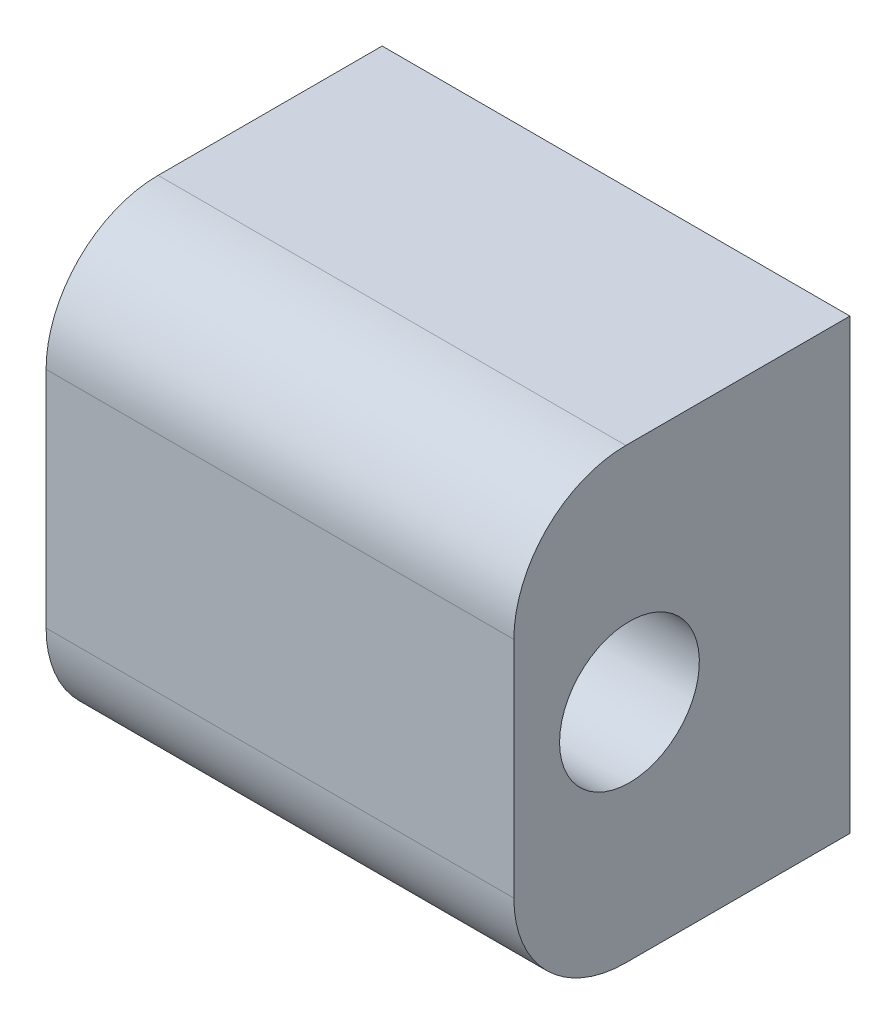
from build123d import *
from OCP.BRepFilletAPI import BRepFilletAPI_MakeChamfer

# Parameters (mm, degrees)
BOSS_EXTRUDE2_DEPTH = 19.05
SKETCH5_R           = 3.9624
CUT_EXTRUDE1_DEPTH  = 31.75
SKETCH6_R           = 3.175
CUT_EXTRUDE3_DEPTH  = 17.272
FILLET1_R           = 6.35
CHAMFER1_SIZE       = 1.778
CHAMFER1_SIZE2      = 2.95908892


with BuildPart() as part:
    # Sketch4 → Boss-Extrude2 (new body)
    with BuildSketch(Plane.XY):
        Polygon((-13.2588, -12.7), (13.2588, -12.7), (13.2588, 0), (13.2588, 12.7), (-13.2588, 12.7), (-13.2588, 0), align=None)
    extrude(amount=BOSS_EXTRUDE2_DEPTH)

    # Sketch5 → Cut-Extrude1 (cut)
    with BuildSketch(Plane.ZY.offset(13.2588)):
        with Locations(Location((12.4968, 0, 0), (0, 0, 270))):
            Circle(SKETCH5_R)
    extrude(amount=-CUT_EXTRUDE1_DEPTH, mode=Mode.SUBTRACT)

    # Sketch6 → Cut-Extrude3 (cut)
    with BuildSketch(Plane.XY):
        with Locations((-7.1374, -7.5438)):
            Circle(SKETCH6_R)
        with Locations((7.1374, -7.5438)):
            Circle(SKETCH6_R)
        with Locations((-7.1374, 7.5438)):
            Circle(SKETCH6_R)
        with Locations((7.1374, 7.5438)):
            Circle(SKETCH6_R)
    extrude(amount=CUT_EXTRUDE3_DEPTH, mode=Mode.SUBTRACT)

    # Fillet1
    fillet1_edges = [part.edges().sort_by_distance(p)[0] for p in [
        (0, 12.7, 19.05),
        (0, -12.7, 19.05),
    ]]
    fillet(fillet1_edges, radius=FILLET1_R)

    # Chamfer1: one chamfer whose edges measure the first distance from different faces: ONE call of the kernel's chamfer builder (chamfer() names one face for all edges)
    chamfer1_edges_1 = [part.edges().sort_by_distance(p)[0] for p in [
        (-10.3124, -7.5438, 17.272),
    ]]
    chamfer1_side_1 = [part.faces().sort_by_distance(p)[0] for p in [
        (-10.3124, -7.5438, 8.636),
    ]]
    chamfer1_edges_2 = [part.edges().sort_by_distance(p)[0] for p in [
        (3.9624, -7.5438, 17.272),
    ]]
    chamfer1_side_2 = [part.faces().sort_by_distance(p)[0] for p in [
        (3.9624, -7.5438, 8.636),
    ]]
    chamfer1_edges_3 = [part.edges().sort_by_distance(p)[0] for p in [
        (-10.3124, 7.5438, 17.272),
    ]]
    chamfer1_side_3 = [part.faces().sort_by_distance(p)[0] for p in [
        (-10.3124, 7.5438, 8.636),
    ]]
    chamfer1_edges_4 = [part.edges().sort_by_distance(p)[0] for p in [
        (3.9624, 7.5438, 17.272),
    ]]
    chamfer1_side_4 = [part.faces().sort_by_distance(p)[0] for p in [
        (3.9624, 7.5438, 8.636),
    ]]
    chamfer1 = BRepFilletAPI_MakeChamfer(part.part.solid().wrapped)
    for e in chamfer1_edges_1:
        chamfer1.Add(CHAMFER1_SIZE, CHAMFER1_SIZE2, e.wrapped, chamfer1_side_1[0].wrapped)  # the first distance lies on this face
    for e in chamfer1_edges_2:
        chamfer1.Add(CHAMFER1_SIZE, CHAMFER1_SIZE2, e.wrapped, chamfer1_side_2[0].wrapped)  # the first distance lies on this face
    for e in chamfer1_edges_3:
        chamfer1.Add(CHAMFER1_SIZE, CHAMFER1_SIZE2, e.wrapped, chamfer1_side_3[0].wrapped)  # the first distance lies on this face
    for e in chamfer1_edges_4:
        chamfer1.Add(CHAMFER1_SIZE, CHAMFER1_SIZE2, e.wrapped, chamfer1_side_4[0].wrapped)  # the first distance lies on this face
    add(Compound.cast(chamfer1.Shape()), mode=Mode.REPLACE)


solid = part.part
